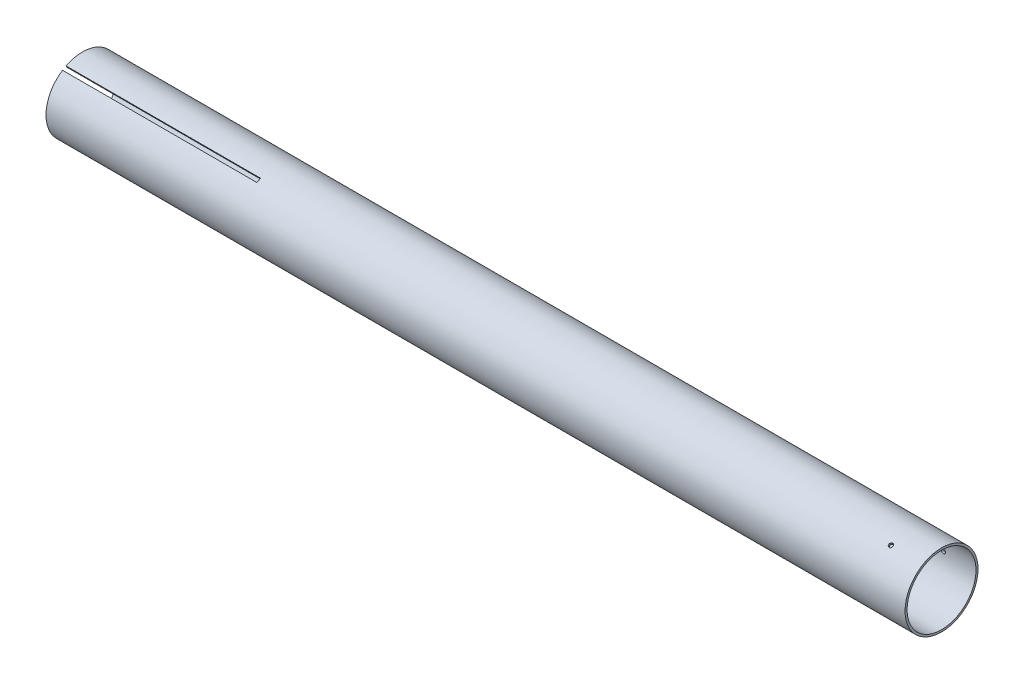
from build123d import *

# Parameters (mm, degrees)
SKETCH1_R          = 28.575
SKETCH1_R_2        = 26.9875
EXTRUDE1_DEPTH     = 673.1
SKETCH3_R          = 1.5875
CUT_EXTRUDE1_DEPTH = 675.311998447
SKETCH4_R          = 1.5875
CUT_EXTRUDE2_DEPTH = 675.311998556
SKETCH5_R          = 1.5875
CUT_EXTRUDE3_DEPTH = 675.311998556
SKETCH6_W          = 152.4
SKETCH6_H          = 3.175
CUT_EXTRUDE4_DEPTH = 675.311998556
SKETCH7_W          = 152.4
SKETCH7_H          = 3.175
CUT_EXTRUDE5_DEPTH = 675.311998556
SKETCH8_W          = 152.4
SKETCH8_H          = 3.175
CUT_EXTRUDE6_DEPTH = 675.311998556


with BuildPart() as part:
    # Sketch1 → Extrude1 (new body)
    with BuildSketch(Plane(origin=(0, 0, 0), x_dir=(0, 0, -1), z_dir=(1, 0, 0))):
        Circle(SKETCH1_R)
        Circle(SKETCH1_R_2, mode=Mode.SUBTRACT)
    extrude(amount=EXTRUDE1_DEPTH)

    # Sketch3 → Cut-Extrude1 (cut, through all)
    with BuildSketch(Plane.XY):
        with Locations((647.7, 0)):
            Circle(SKETCH3_R)
    extrude(amount=-CUT_EXTRUDE1_DEPTH, mode=Mode.SUBTRACT)

    # Sketch4 → Cut-Extrude2 (cut, through all)
    with BuildSketch(Plane(origin=(0, 0, 0), x_dir=(1, 0, 0), z_dir=(0, -0.8660254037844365, -0.500000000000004))):
        with Locations(Location((647.7, 0, 0), (0, 0, 270))):
            Circle(SKETCH4_R)
    extrude(amount=-CUT_EXTRUDE2_DEPTH, mode=Mode.SUBTRACT)

    # Sketch5 → Cut-Extrude3 (cut, through all)
    with BuildSketch(Plane(origin=(0, 0, 0), x_dir=(-1, 0, 0), z_dir=(0, 0.8660254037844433, -0.49999999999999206))):
        with Locations(Location((-647.7, 0, 0), (0, 0, 90))):
            Circle(SKETCH5_R)
    extrude(amount=-CUT_EXTRUDE3_DEPTH, mode=Mode.SUBTRACT)

    # Sketch6 → Cut-Extrude4 (cut, through all)
    with BuildSketch(Plane.XY):
        with Locations((76.2, 0)):
            Rectangle(SKETCH6_W, SKETCH6_H)
    extrude(amount=-CUT_EXTRUDE4_DEPTH, mode=Mode.SUBTRACT)

    # Sketch7 → Cut-Extrude5 (cut, through all)
    with BuildSketch(Plane(origin=(0, 0, 0), x_dir=(1, 0, 0), z_dir=(0, -0.8660254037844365, -0.500000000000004))):
        with Locations((76.2, 0)):
            Rectangle(SKETCH7_W, SKETCH7_H)
    extrude(amount=-CUT_EXTRUDE5_DEPTH, mode=Mode.SUBTRACT)

    # Sketch8 → Cut-Extrude6 (cut, through all)
    with BuildSketch(Plane(origin=(0, 0, 0), x_dir=(-1, 0, 0), z_dir=(0, 0.8660254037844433, -0.49999999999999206))):
        with Locations((-76.2, 0)):
            Rectangle(SKETCH8_W, SKETCH8_H)
    extrude(amount=-CUT_EXTRUDE6_DEPTH, mode=Mode.SUBTRACT)


solid = part.part
